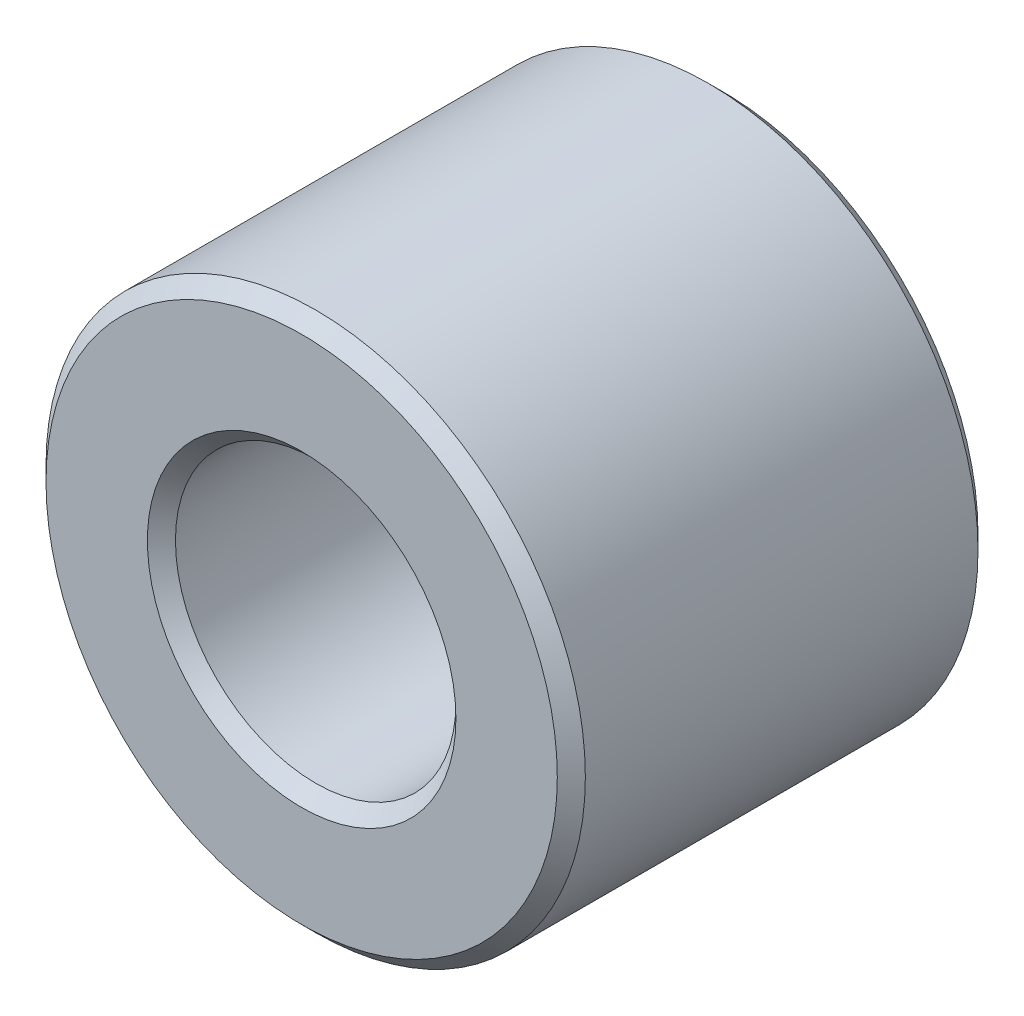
ISO-10303-21;
HEADER;
FILE_DESCRIPTION(('STEP AP214'),'2;1');
FILE_NAME('part.step','',(''),(''),'','','');
FILE_SCHEMA(('AUTOMOTIVE_DESIGN { 1 0 10303 214 1 1 1 1 }'));
ENDSEC;
DATA;
#1=APPLICATION_CONTEXT('core data for automotive mechanical design processes');
#2=APPLICATION_PROTOCOL_DEFINITION('international standard','automotive_design',2000,#1);
#3=PRODUCT_CONTEXT('',#1,'mechanical');
#4=PRODUCT('Part','Part','',(#3));
#5=PRODUCT_RELATED_PRODUCT_CATEGORY('part','',(#4));
#6=PRODUCT_DEFINITION_FORMATION('','',#4);
#7=PRODUCT_DEFINITION_CONTEXT('part definition',#1,'design');
#8=PRODUCT_DEFINITION('design','',#6,#7);
#9=PRODUCT_DEFINITION_SHAPE('','',#8);
#10=(LENGTH_UNIT() NAMED_UNIT(*) SI_UNIT(.MILLI.,.METRE.));
#11=(NAMED_UNIT(*) PLANE_ANGLE_UNIT() SI_UNIT($,.RADIAN.));
#12=(NAMED_UNIT(*) SI_UNIT($,.STERADIAN.) SOLID_ANGLE_UNIT());
#13=UNCERTAINTY_MEASURE_WITH_UNIT(LENGTH_MEASURE(1.E-05),#10,'distance_accuracy_value','');
#14=(GEOMETRIC_REPRESENTATION_CONTEXT(3) GLOBAL_UNCERTAINTY_ASSIGNED_CONTEXT((#13)) GLOBAL_UNIT_ASSIGNED_CONTEXT((#10,
#11,#12)) REPRESENTATION_CONTEXT('',''));
#15=CARTESIAN_POINT('',(0.,0.,0.));
#16=DIRECTION('',(0.,0.,1.));
#17=DIRECTION('',(1.,0.,0.));
#18=AXIS2_PLACEMENT_3D('',#15,#16,#17);
#19=CARTESIAN_POINT('',(0.,0.,19.5));
#20=DIRECTION('',(0.,0.,1.));
#21=DIRECTION('',(1.,0.,0.));
#22=AXIS2_PLACEMENT_3D('',#19,#20,#21);
#23=PLANE('',#22);
#24=CARTESIAN_POINT('',(0.,0.,19.5));
#25=DIRECTION('',(0.,0.,1.));
#26=DIRECTION('',(1.,0.,0.));
#27=AXIS2_PLACEMENT_3D('',#24,#25,#26);
#28=CIRCLE('',#27,14.3);
#29=CARTESIAN_POINT('',(14.3,0.,19.5));
#30=VERTEX_POINT('',#29);
#31=EDGE_CURVE('E10',#30,#30,#28,.F.);
#32=ORIENTED_EDGE('',*,*,#31,.T.);
#33=EDGE_LOOP('',(#32));
#34=FACE_BOUND('',#33,.T.);
#35=CARTESIAN_POINT('',(0.,0.,19.5));
#36=DIRECTION('',(0.,0.,1.));
#37=DIRECTION('',(1.,0.,0.));
#38=AXIS2_PLACEMENT_3D('',#35,#36,#37);
#39=CIRCLE('',#38,23.7);
#40=CARTESIAN_POINT('',(-23.7,0.,19.5));
#41=VERTEX_POINT('',#40);
#42=EDGE_CURVE('E45',#41,#41,#39,.T.);
#43=ORIENTED_EDGE('',*,*,#42,.T.);
#44=EDGE_LOOP('',(#43));
#45=FACE_BOUND('',#44,.T.);
#46=ADVANCED_FACE('F37',(#34,#45),#23,.T.);
#47=CARTESIAN_POINT('',(0.,0.,-19.5));
#48=DIRECTION('',(0.,0.,1.));
#49=DIRECTION('',(1.,0.,0.));
#50=AXIS2_PLACEMENT_3D('',#47,#48,#49);
#51=PLANE('',#50);
#52=CARTESIAN_POINT('',(0.,0.,-19.5));
#53=DIRECTION('',(0.,0.,1.));
#54=DIRECTION('',(1.,0.,0.));
#55=AXIS2_PLACEMENT_3D('',#52,#53,#54);
#56=CIRCLE('',#55,14.3);
#57=CARTESIAN_POINT('',(14.3,0.,-19.5));
#58=VERTEX_POINT('',#57);
#59=EDGE_CURVE('E71',#58,#58,#56,.T.);
#60=ORIENTED_EDGE('',*,*,#59,.T.);
#61=EDGE_LOOP('',(#60));
#62=FACE_BOUND('',#61,.T.);
#63=CARTESIAN_POINT('',(0.,0.,-19.5));
#64=DIRECTION('',(0.,0.,1.));
#65=DIRECTION('',(1.,0.,0.));
#66=AXIS2_PLACEMENT_3D('',#63,#64,#65);
#67=CIRCLE('',#66,23.7);
#68=CARTESIAN_POINT('',(23.7,0.,-19.5));
#69=VERTEX_POINT('',#68);
#70=EDGE_CURVE('E74',#69,#69,#67,.F.);
#71=ORIENTED_EDGE('',*,*,#70,.T.);
#72=EDGE_LOOP('',(#71));
#73=FACE_BOUND('',#72,.T.);
#74=ADVANCED_FACE('F78',(#62,#73),#51,.F.);
#75=CARTESIAN_POINT('',(0.,0.,19.5));
#76=DIRECTION('',(0.,0.,-1.));
#77=DIRECTION('',(-1.,0.,0.));
#78=AXIS2_PLACEMENT_3D('',#75,#76,#77);
#79=CYLINDRICAL_SURFACE('',#78,25.);
#80=CARTESIAN_POINT('',(0.,0.,-18.2));
#81=DIRECTION('',(0.,0.,1.));
#82=DIRECTION('',(1.,0.,0.));
#83=AXIS2_PLACEMENT_3D('',#80,#81,#82);
#84=CIRCLE('',#83,25.);
#85=CARTESIAN_POINT('',(25.,0.,-18.2));
#86=VERTEX_POINT('',#85);
#87=EDGE_CURVE('E52',#86,#86,#84,.T.);
#88=ORIENTED_EDGE('',*,*,#87,.T.);
#89=EDGE_LOOP('',(#88));
#90=FACE_BOUND('',#89,.T.);
#91=CARTESIAN_POINT('',(0.,0.,18.2));
#92=DIRECTION('',(0.,0.,1.));
#93=DIRECTION('',(1.,0.,0.));
#94=AXIS2_PLACEMENT_3D('',#91,#92,#93);
#95=CIRCLE('',#94,25.);
#96=CARTESIAN_POINT('',(-25.,0.,18.2));
#97=VERTEX_POINT('',#96);
#98=EDGE_CURVE('E58',#97,#97,#95,.F.);
#99=ORIENTED_EDGE('',*,*,#98,.T.);
#100=EDGE_LOOP('',(#99));
#101=FACE_BOUND('',#100,.T.);
#102=ADVANCED_FACE('F88',(#90,#101),#79,.T.);
#103=CARTESIAN_POINT('',(0.,0.,19.5));
#104=DIRECTION('',(0.,0.,-1.));
#105=DIRECTION('',(-1.,0.,0.));
#106=AXIS2_PLACEMENT_3D('',#103,#104,#105);
#107=CYLINDRICAL_SURFACE('',#106,13.);
#108=CARTESIAN_POINT('',(0.,0.,-18.2));
#109=DIRECTION('',(0.,0.,1.));
#110=DIRECTION('',(1.,0.,0.));
#111=AXIS2_PLACEMENT_3D('',#108,#109,#110);
#112=CIRCLE('',#111,13.);
#113=CARTESIAN_POINT('',(13.,0.,-18.2));
#114=VERTEX_POINT('',#113);
#115=EDGE_CURVE('E64',#114,#114,#112,.F.);
#116=ORIENTED_EDGE('',*,*,#115,.T.);
#117=EDGE_LOOP('',(#116));
#118=FACE_BOUND('',#117,.T.);
#119=CARTESIAN_POINT('',(0.,0.,18.2));
#120=DIRECTION('',(0.,0.,1.));
#121=DIRECTION('',(1.,0.,0.));
#122=AXIS2_PLACEMENT_3D('',#119,#120,#121);
#123=CIRCLE('',#122,13.);
#124=CARTESIAN_POINT('',(13.,0.,18.2));
#125=VERTEX_POINT('',#124);
#126=EDGE_CURVE('E68',#125,#125,#123,.T.);
#127=ORIENTED_EDGE('',*,*,#126,.T.);
#128=EDGE_LOOP('',(#127));
#129=FACE_BOUND('',#128,.T.);
#130=ADVANCED_FACE('F91',(#118,#129),#107,.F.);
#131=CARTESIAN_POINT('',(0.,0.,-19.5));
#132=DIRECTION('',(0.,0.,-1.));
#133=DIRECTION('',(-1.,0.,0.));
#134=AXIS2_PLACEMENT_3D('',#131,#132,#133);
#135=CONICAL_SURFACE('',#134,14.3,0.785398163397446);
#136=ORIENTED_EDGE('',*,*,#115,.F.);
#137=EDGE_LOOP('',(#136));
#138=FACE_BOUND('',#137,.T.);
#139=ORIENTED_EDGE('',*,*,#59,.F.);
#140=EDGE_LOOP('',(#139));
#141=FACE_BOUND('',#140,.T.);
#142=ADVANCED_FACE('F84',(#138,#141),#135,.F.);
#143=CARTESIAN_POINT('',(0.,0.,-18.2));
#144=DIRECTION('',(0.,0.,1.));
#145=DIRECTION('',(1.,0.,0.));
#146=AXIS2_PLACEMENT_3D('',#143,#144,#145);
#147=CONICAL_SURFACE('',#146,25.,0.785398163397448);
#148=ORIENTED_EDGE('',*,*,#70,.F.);
#149=EDGE_LOOP('',(#148));
#150=FACE_BOUND('',#149,.T.);
#151=ORIENTED_EDGE('',*,*,#87,.F.);
#152=EDGE_LOOP('',(#151));
#153=FACE_BOUND('',#152,.T.);
#154=ADVANCED_FACE('F80',(#150,#153),#147,.T.);
#155=CARTESIAN_POINT('',(0.,0.,18.2));
#156=DIRECTION('',(0.,0.,1.));
#157=DIRECTION('',(1.,0.,0.));
#158=AXIS2_PLACEMENT_3D('',#155,#156,#157);
#159=CONICAL_SURFACE('',#158,13.,0.78539816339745);
#160=CARTESIAN_POINT('',(14.3,0.,19.5));
#161=CARTESIAN_POINT('',(14.2864583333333,0.,19.4864583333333));
#162=CARTESIAN_POINT('',(14.2729166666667,0.,19.4729166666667));
#163=CARTESIAN_POINT('',(14.2458333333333,0.,19.4458333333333));
#164=CARTESIAN_POINT('',(14.2322916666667,0.,19.4322916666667));
#165=CARTESIAN_POINT('',(14.2052083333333,0.,19.4052083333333));
#166=CARTESIAN_POINT('',(14.1916666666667,0.,19.3916666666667));
#167=CARTESIAN_POINT('',(14.1645833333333,0.,19.3645833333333));
#168=CARTESIAN_POINT('',(14.1510416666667,0.,19.3510416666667));
#169=CARTESIAN_POINT('',(14.1239583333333,0.,19.3239583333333));
#170=CARTESIAN_POINT('',(14.1104166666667,0.,19.3104166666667));
#171=CARTESIAN_POINT('',(14.0833333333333,0.,19.2833333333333));
#172=CARTESIAN_POINT('',(14.0697916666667,0.,19.2697916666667));
#173=CARTESIAN_POINT('',(14.0427083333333,0.,19.2427083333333));
#174=CARTESIAN_POINT('',(14.0291666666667,0.,19.2291666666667));
#175=CARTESIAN_POINT('',(14.0020833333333,0.,19.2020833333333));
#176=CARTESIAN_POINT('',(13.9885416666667,0.,19.1885416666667));
#177=CARTESIAN_POINT('',(13.9614583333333,0.,19.1614583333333));
#178=CARTESIAN_POINT('',(13.9479166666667,0.,19.1479166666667));
#179=CARTESIAN_POINT('',(13.9208333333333,0.,19.1208333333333));
#180=CARTESIAN_POINT('',(13.9072916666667,0.,19.1072916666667));
#181=CARTESIAN_POINT('',(13.8802083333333,0.,19.0802083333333));
#182=CARTESIAN_POINT('',(13.8666666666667,0.,19.0666666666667));
#183=CARTESIAN_POINT('',(13.8395833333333,0.,19.0395833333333));
#184=CARTESIAN_POINT('',(13.8260416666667,0.,19.0260416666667));
#185=CARTESIAN_POINT('',(13.7989583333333,0.,18.9989583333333));
#186=CARTESIAN_POINT('',(13.7854166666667,0.,18.9854166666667));
#187=CARTESIAN_POINT('',(13.7583333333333,0.,18.9583333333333));
#188=CARTESIAN_POINT('',(13.7447916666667,0.,18.9447916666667));
#189=CARTESIAN_POINT('',(13.7177083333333,0.,18.9177083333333));
#190=CARTESIAN_POINT('',(13.7041666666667,0.,18.9041666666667));
#191=CARTESIAN_POINT('',(13.6770833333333,0.,18.8770833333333));
#192=CARTESIAN_POINT('',(13.6635416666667,0.,18.8635416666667));
#193=CARTESIAN_POINT('',(13.6364583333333,0.,18.8364583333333));
#194=CARTESIAN_POINT('',(13.6229166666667,0.,18.8229166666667));
#195=CARTESIAN_POINT('',(13.5958333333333,0.,18.7958333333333));
#196=CARTESIAN_POINT('',(13.5822916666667,0.,18.7822916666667));
#197=CARTESIAN_POINT('',(13.5552083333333,0.,18.7552083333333));
#198=CARTESIAN_POINT('',(13.5416666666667,0.,18.7416666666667));
#199=CARTESIAN_POINT('',(13.5145833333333,0.,18.7145833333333));
#200=CARTESIAN_POINT('',(13.5010416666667,0.,18.7010416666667));
#201=CARTESIAN_POINT('',(13.4739583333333,0.,18.6739583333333));
#202=CARTESIAN_POINT('',(13.4604166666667,0.,18.6604166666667));
#203=CARTESIAN_POINT('',(13.4333333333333,0.,18.6333333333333));
#204=CARTESIAN_POINT('',(13.4197916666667,0.,18.6197916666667));
#205=CARTESIAN_POINT('',(13.3927083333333,0.,18.5927083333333));
#206=CARTESIAN_POINT('',(13.3791666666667,0.,18.5791666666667));
#207=CARTESIAN_POINT('',(13.3520833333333,0.,18.5520833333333));
#208=CARTESIAN_POINT('',(13.3385416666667,0.,18.5385416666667));
#209=CARTESIAN_POINT('',(13.3114583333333,0.,18.5114583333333));
#210=CARTESIAN_POINT('',(13.2979166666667,0.,18.4979166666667));
#211=CARTESIAN_POINT('',(13.2708333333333,0.,18.4708333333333));
#212=CARTESIAN_POINT('',(13.2572916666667,0.,18.4572916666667));
#213=CARTESIAN_POINT('',(13.2302083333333,0.,18.4302083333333));
#214=CARTESIAN_POINT('',(13.2166666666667,0.,18.4166666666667));
#215=CARTESIAN_POINT('',(13.1895833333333,0.,18.3895833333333));
#216=CARTESIAN_POINT('',(13.1760416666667,0.,18.3760416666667));
#217=CARTESIAN_POINT('',(13.1489583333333,0.,18.3489583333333));
#218=CARTESIAN_POINT('',(13.1354166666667,0.,18.3354166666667));
#219=CARTESIAN_POINT('',(13.1083333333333,0.,18.3083333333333));
#220=CARTESIAN_POINT('',(13.0947916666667,0.,18.2947916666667));
#221=CARTESIAN_POINT('',(13.0677083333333,0.,18.2677083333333));
#222=CARTESIAN_POINT('',(13.0541666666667,0.,18.2541666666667));
#223=CARTESIAN_POINT('',(13.0270833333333,0.,18.2270833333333));
#224=CARTESIAN_POINT('',(13.0135416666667,0.,18.2135416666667));
#225=CARTESIAN_POINT('',(13.,0.,18.2));
#226=B_SPLINE_CURVE_WITH_KNOTS('',3,(#160,#161,#162,#163,#164,#165,#166,#167,#168,#169,#170,
#171,#172,#173,#174,#175,#176,#177,#178,#179,#180,#181,#182,#183,#184,#185,#186,#187,#188,#189,
#190,#191,#192,#193,#194,#195,#196,#197,#198,#199,#200,#201,#202,#203,#204,#205,#206,#207,#208,
#209,#210,#211,#212,#213,#214,#215,#216,#217,#218,#219,#220,#221,#222,#223,#224,#225),
.UNSPECIFIED.,.F.,.F.,(4,2,2,2,2,2,2,2,2,2,2,2,2,2,2,2,2,2,2,2,2,2,2,2,2,2,2,2,2,2,2,2,4),(0.,
0.057452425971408,0.114904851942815,0.17235727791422,0.229809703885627,0.287262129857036,
0.344714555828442,0.402166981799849,0.459619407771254,0.517071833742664,0.574524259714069,
0.631976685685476,0.689429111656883,0.746881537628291,0.804333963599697,0.861786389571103,
0.91923881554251,0.976691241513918,1.03414366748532,1.09159609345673,1.14904851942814,
1.20650094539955,1.26395337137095,1.32140579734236,1.37885822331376,1.43631064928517,
1.49376307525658,1.55121550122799,1.6086679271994,1.6661203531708,1.72357277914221,
1.78102520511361,1.83847763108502),.UNSPECIFIED.);
#227=EDGE_CURVE('BSEAM83',#30,#125,#226,.T.);
#228=ORIENTED_EDGE('',*,*,#31,.F.);
#229=ORIENTED_EDGE('',*,*,#126,.F.);
#230=ORIENTED_EDGE('',*,*,#227,.T.);
#231=ORIENTED_EDGE('',*,*,#227,.F.);
#232=EDGE_LOOP('',(#228,#230,#229,#231));
#233=FACE_BOUND('',#232,.T.);
#234=ADVANCED_FACE('F83',(#233),#159,.F.);
#235=CARTESIAN_POINT('',(0.,0.,19.5));
#236=DIRECTION('',(0.,0.,-1.));
#237=DIRECTION('',(-1.,0.,0.));
#238=AXIS2_PLACEMENT_3D('',#235,#236,#237);
#239=CONICAL_SURFACE('',#238,23.7,0.785398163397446);
#240=CARTESIAN_POINT('',(-25.,0.,18.2));
#241=CARTESIAN_POINT('',(-24.9864583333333,0.,18.2135416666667));
#242=CARTESIAN_POINT('',(-24.9729166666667,0.,18.2270833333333));
#243=CARTESIAN_POINT('',(-24.9458333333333,0.,18.2541666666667));
#244=CARTESIAN_POINT('',(-24.9322916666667,0.,18.2677083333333));
#245=CARTESIAN_POINT('',(-24.9052083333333,0.,18.2947916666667));
#246=CARTESIAN_POINT('',(-24.8916666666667,0.,18.3083333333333));
#247=CARTESIAN_POINT('',(-24.8645833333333,0.,18.3354166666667));
#248=CARTESIAN_POINT('',(-24.8510416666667,0.,18.3489583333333));
#249=CARTESIAN_POINT('',(-24.8239583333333,0.,18.3760416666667));
#250=CARTESIAN_POINT('',(-24.8104166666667,0.,18.3895833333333));
#251=CARTESIAN_POINT('',(-24.7833333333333,0.,18.4166666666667));
#252=CARTESIAN_POINT('',(-24.7697916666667,0.,18.4302083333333));
#253=CARTESIAN_POINT('',(-24.7427083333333,0.,18.4572916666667));
#254=CARTESIAN_POINT('',(-24.7291666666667,0.,18.4708333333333));
#255=CARTESIAN_POINT('',(-24.7020833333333,0.,18.4979166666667));
#256=CARTESIAN_POINT('',(-24.6885416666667,0.,18.5114583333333));
#257=CARTESIAN_POINT('',(-24.6614583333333,0.,18.5385416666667));
#258=CARTESIAN_POINT('',(-24.6479166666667,0.,18.5520833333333));
#259=CARTESIAN_POINT('',(-24.6208333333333,0.,18.5791666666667));
#260=CARTESIAN_POINT('',(-24.6072916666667,0.,18.5927083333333));
#261=CARTESIAN_POINT('',(-24.5802083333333,0.,18.6197916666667));
#262=CARTESIAN_POINT('',(-24.5666666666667,0.,18.6333333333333));
#263=CARTESIAN_POINT('',(-24.5395833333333,0.,18.6604166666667));
#264=CARTESIAN_POINT('',(-24.5260416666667,0.,18.6739583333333));
#265=CARTESIAN_POINT('',(-24.4989583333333,0.,18.7010416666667));
#266=CARTESIAN_POINT('',(-24.4854166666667,0.,18.7145833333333));
#267=CARTESIAN_POINT('',(-24.4583333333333,0.,18.7416666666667));
#268=CARTESIAN_POINT('',(-24.4447916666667,0.,18.7552083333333));
#269=CARTESIAN_POINT('',(-24.4177083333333,0.,18.7822916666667));
#270=CARTESIAN_POINT('',(-24.4041666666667,0.,18.7958333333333));
#271=CARTESIAN_POINT('',(-24.3770833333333,0.,18.8229166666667));
#272=CARTESIAN_POINT('',(-24.3635416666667,0.,18.8364583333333));
#273=CARTESIAN_POINT('',(-24.3364583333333,0.,18.8635416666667));
#274=CARTESIAN_POINT('',(-24.3229166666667,0.,18.8770833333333));
#275=CARTESIAN_POINT('',(-24.2958333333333,0.,18.9041666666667));
#276=CARTESIAN_POINT('',(-24.2822916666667,0.,18.9177083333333));
#277=CARTESIAN_POINT('',(-24.2552083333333,0.,18.9447916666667));
#278=CARTESIAN_POINT('',(-24.2416666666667,0.,18.9583333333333));
#279=CARTESIAN_POINT('',(-24.2145833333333,0.,18.9854166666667));
#280=CARTESIAN_POINT('',(-24.2010416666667,0.,18.9989583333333));
#281=CARTESIAN_POINT('',(-24.1739583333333,0.,19.0260416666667));
#282=CARTESIAN_POINT('',(-24.1604166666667,0.,19.0395833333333));
#283=CARTESIAN_POINT('',(-24.1333333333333,0.,19.0666666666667));
#284=CARTESIAN_POINT('',(-24.1197916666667,0.,19.0802083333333));
#285=CARTESIAN_POINT('',(-24.0927083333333,0.,19.1072916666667));
#286=CARTESIAN_POINT('',(-24.0791666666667,0.,19.1208333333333));
#287=CARTESIAN_POINT('',(-24.0520833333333,0.,19.1479166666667));
#288=CARTESIAN_POINT('',(-24.0385416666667,0.,19.1614583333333));
#289=CARTESIAN_POINT('',(-24.0114583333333,0.,19.1885416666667));
#290=CARTESIAN_POINT('',(-23.9979166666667,0.,19.2020833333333));
#291=CARTESIAN_POINT('',(-23.9708333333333,0.,19.2291666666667));
#292=CARTESIAN_POINT('',(-23.9572916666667,0.,19.2427083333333));
#293=CARTESIAN_POINT('',(-23.9302083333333,0.,19.2697916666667));
#294=CARTESIAN_POINT('',(-23.9166666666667,0.,19.2833333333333));
#295=CARTESIAN_POINT('',(-23.8895833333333,0.,19.3104166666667));
#296=CARTESIAN_POINT('',(-23.8760416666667,0.,19.3239583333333));
#297=CARTESIAN_POINT('',(-23.8489583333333,0.,19.3510416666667));
#298=CARTESIAN_POINT('',(-23.8354166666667,0.,19.3645833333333));
#299=CARTESIAN_POINT('',(-23.8083333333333,0.,19.3916666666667));
#300=CARTESIAN_POINT('',(-23.7947916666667,0.,19.4052083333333));
#301=CARTESIAN_POINT('',(-23.7677083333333,0.,19.4322916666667));
#302=CARTESIAN_POINT('',(-23.7541666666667,0.,19.4458333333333));
#303=CARTESIAN_POINT('',(-23.7270833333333,0.,19.4729166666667));
#304=CARTESIAN_POINT('',(-23.7135416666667,0.,19.4864583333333));
#305=CARTESIAN_POINT('',(-23.7,0.,19.5));
#306=B_SPLINE_CURVE_WITH_KNOTS('',3,(#240,#241,#242,#243,#244,#245,#246,#247,#248,#249,#250,
#251,#252,#253,#254,#255,#256,#257,#258,#259,#260,#261,#262,#263,#264,#265,#266,#267,#268,#269,
#270,#271,#272,#273,#274,#275,#276,#277,#278,#279,#280,#281,#282,#283,#284,#285,#286,#287,#288,
#289,#290,#291,#292,#293,#294,#295,#296,#297,#298,#299,#300,#301,#302,#303,#304,#305),
.UNSPECIFIED.,.F.,.F.,(4,2,2,2,2,2,2,2,2,2,2,2,2,2,2,2,2,2,2,2,2,2,2,2,2,2,2,2,2,2,2,2,4),(0.,
0.0574524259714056,0.114904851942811,0.172357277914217,0.229809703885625,0.28726212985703,
0.344714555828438,0.402166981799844,0.459619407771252,0.517071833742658,0.574524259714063,
0.631976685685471,0.689429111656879,0.746881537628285,0.80433396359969,0.861786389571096,
0.919238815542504,0.976691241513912,1.03414366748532,1.09159609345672,1.14904851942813,
1.20650094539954,1.26395337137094,1.32140579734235,1.37885822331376,1.43631064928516,
1.49376307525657,1.55121550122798,1.60866792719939,1.66612035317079,1.7235727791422,
1.7810252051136,1.83847763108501),.UNSPECIFIED.);
#307=EDGE_CURVE('BSEAM39',#97,#41,#306,.T.);
#308=ORIENTED_EDGE('',*,*,#98,.F.);
#309=ORIENTED_EDGE('',*,*,#42,.F.);
#310=ORIENTED_EDGE('',*,*,#307,.T.);
#311=ORIENTED_EDGE('',*,*,#307,.F.);
#312=EDGE_LOOP('',(#308,#310,#309,#311));
#313=FACE_BOUND('',#312,.T.);
#314=ADVANCED_FACE('F39',(#313),#239,.T.);
#315=CLOSED_SHELL('',(#46,#74,#102,#130,#142,#154,#234,#314));
#316=MANIFOLD_SOLID_BREP('B2',#315);
#317=ADVANCED_BREP_SHAPE_REPRESENTATION('',(#18,#316),#14);
#318=SHAPE_DEFINITION_REPRESENTATION(#9,#317);
ENDSEC;
END-ISO-10303-21;
